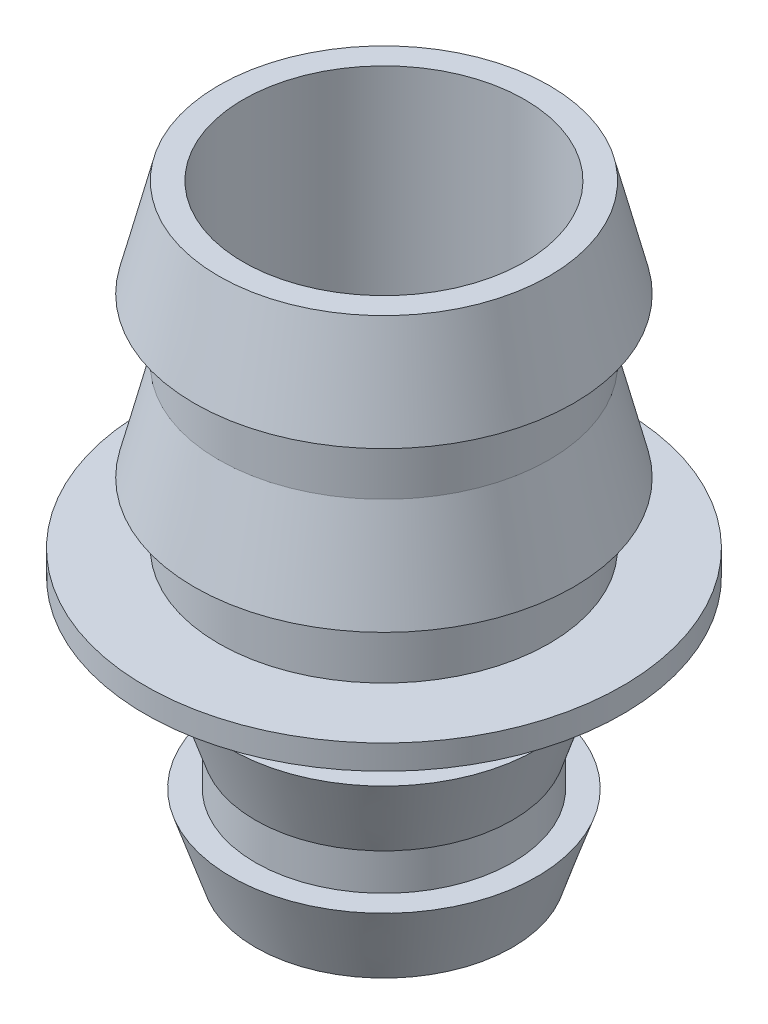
from build123d import *


with BuildPart() as part:
    # Sketch1 → Revolve1 (revolve)
    with BuildSketch(Plane.XY, mode=Mode.PRIVATE) as revolve1_sk:
        Polygon((-6.75, 10.5), (-7.75, 6.5), (-6.75, 6.5), (-6.75, 4), (-7.75, 0), (-6.75, 0), (-6.75, -2.5), (-9.75, -2.5), (-9.75, -3.5), (-6.75, -3.5), (-5.25, -4.5), (-5.25, -6.5), (-6.25, -6.5), (-5.25, -9.5), (-5.25, -11), (-6.25, -11), (-5.25, -14), (-4.25, -14), (-4.25, -3.5), (-5.75, -2.5), (-5.75, 10.5), align=None)
    revolve(revolve1_sk.sketch.rotate(Axis((0, 0, 0), (0, 1, 0)), 270), axis=Axis((0, 0, 0), (0, 1, 0)))


solid = part.part
